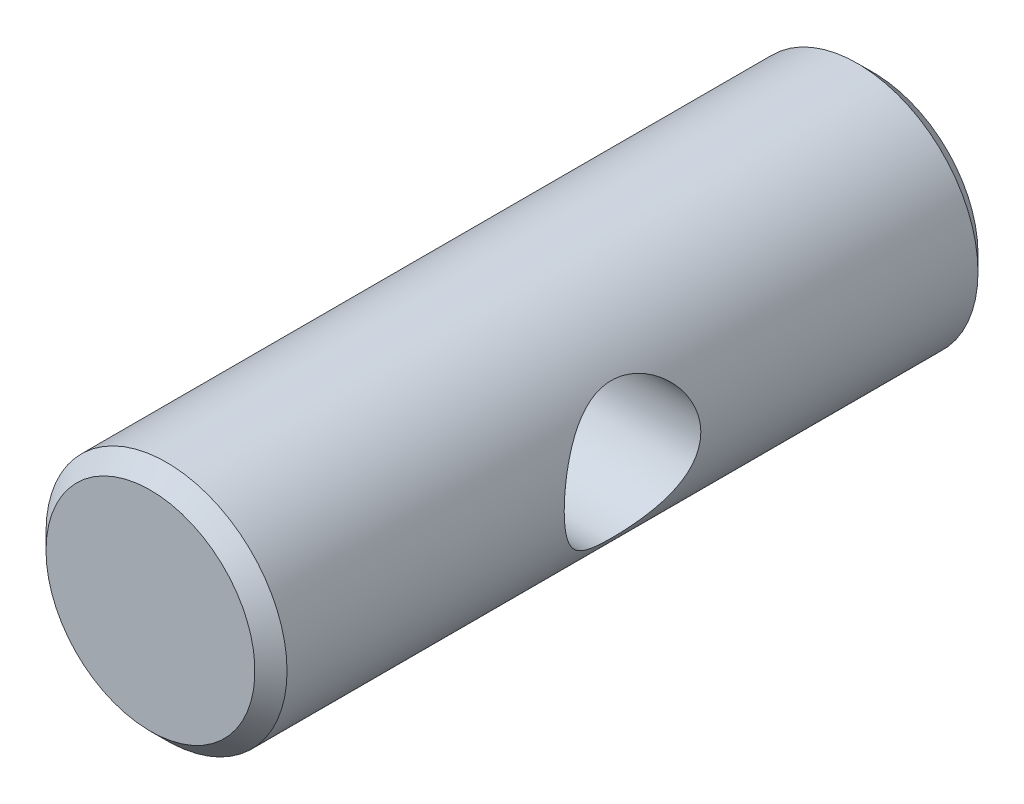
ISO-10303-21;
HEADER;
FILE_DESCRIPTION(('STEP AP214'),'2;1');
FILE_NAME('part.step','',(''),(''),'','','');
FILE_SCHEMA(('AUTOMOTIVE_DESIGN { 1 0 10303 214 1 1 1 1 }'));
ENDSEC;
DATA;
#1=APPLICATION_CONTEXT('core data for automotive mechanical design processes');
#2=APPLICATION_PROTOCOL_DEFINITION('international standard','automotive_design',2000,#1);
#3=PRODUCT_CONTEXT('',#1,'mechanical');
#4=PRODUCT('Part','Part','',(#3));
#5=PRODUCT_RELATED_PRODUCT_CATEGORY('part','',(#4));
#6=PRODUCT_DEFINITION_FORMATION('','',#4);
#7=PRODUCT_DEFINITION_CONTEXT('part definition',#1,'design');
#8=PRODUCT_DEFINITION('design','',#6,#7);
#9=PRODUCT_DEFINITION_SHAPE('','',#8);
#10=(LENGTH_UNIT() NAMED_UNIT(*) SI_UNIT(.MILLI.,.METRE.));
#11=(NAMED_UNIT(*) PLANE_ANGLE_UNIT() SI_UNIT($,.RADIAN.));
#12=(NAMED_UNIT(*) SI_UNIT($,.STERADIAN.) SOLID_ANGLE_UNIT());
#13=UNCERTAINTY_MEASURE_WITH_UNIT(LENGTH_MEASURE(1.E-05),#10,'distance_accuracy_value','');
#14=(GEOMETRIC_REPRESENTATION_CONTEXT(3) GLOBAL_UNCERTAINTY_ASSIGNED_CONTEXT((#13)) GLOBAL_UNIT_ASSIGNED_CONTEXT((#10,
#11,#12)) REPRESENTATION_CONTEXT('',''));
#15=CARTESIAN_POINT('',(0.,0.,0.));
#16=DIRECTION('',(0.,0.,1.));
#17=DIRECTION('',(1.,0.,0.));
#18=AXIS2_PLACEMENT_3D('',#15,#16,#17);
#19=CARTESIAN_POINT('',(-30.,-7.389644E-13,-45.));
#20=DIRECTION('',(0.,0.,-1.));
#21=DIRECTION('',(-1.,0.,0.));
#22=AXIS2_PLACEMENT_3D('',#19,#20,#21);
#23=PLANE('',#22);
#24=CARTESIAN_POINT('',(-30.,-7.389644E-13,-45.0000000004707));
#25=DIRECTION('',(0.,0.,1.));
#26=DIRECTION('',(1.,0.,0.));
#27=AXIS2_PLACEMENT_3D('',#24,#25,#26);
#28=CIRCLE('',#27,6.50000000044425);
#29=CARTESIAN_POINT('',(-23.4999999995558,-7.389644E-13,-45.0000000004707));
#30=VERTEX_POINT('',#29);
#31=EDGE_CURVE('E17',#30,#30,#28,.T.);
#32=ORIENTED_EDGE('',*,*,#31,.F.);
#33=EDGE_LOOP('',(#32));
#34=FACE_BOUND('',#33,.T.);
#35=ADVANCED_FACE('F14',(#34),#23,.T.);
#36=CARTESIAN_POINT('',(-30.,-7.389644E-13,0.));
#37=DIRECTION('',(0.,0.,1.));
#38=DIRECTION('',(1.,0.,0.));
#39=AXIS2_PLACEMENT_3D('',#36,#37,#38);
#40=PLANE('',#39);
#41=CARTESIAN_POINT('',(-30.,-7.389644E-13,4.54747350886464E-10));
#42=DIRECTION('',(0.,0.,-1.));
#43=DIRECTION('',(-1.,0.,0.));
#44=AXIS2_PLACEMENT_3D('',#41,#42,#43);
#45=CIRCLE('',#44,6.5000000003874);
#46=CARTESIAN_POINT('',(-36.5000000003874,-7.389644E-13,4.54747350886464E-10));
#47=VERTEX_POINT('',#46);
#48=EDGE_CURVE('E35',#47,#47,#45,.T.);
#49=ORIENTED_EDGE('',*,*,#48,.F.);
#50=EDGE_LOOP('',(#49));
#51=FACE_BOUND('',#50,.T.);
#52=ADVANCED_FACE('F75',(#51),#40,.T.);
#53=CARTESIAN_POINT('',(-30.,-7.389644E-13,-43.9999999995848));
#54=DIRECTION('',(0.,0.,1.));
#55=DIRECTION('',(1.,0.,0.));
#56=AXIS2_PLACEMENT_3D('',#53,#54,#55);
#57=CONICAL_SURFACE('',#56,7.49999999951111,0.785398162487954);
#58=ORIENTED_EDGE('',*,*,#31,.T.);
#59=EDGE_LOOP('',(#58));
#60=FACE_BOUND('',#59,.T.);
#61=CARTESIAN_POINT('',(-30.,-7.389644E-13,-44.));
#62=DIRECTION('',(0.,0.,1.));
#63=DIRECTION('',(1.,0.,0.));
#64=AXIS2_PLACEMENT_3D('',#61,#62,#63);
#65=CIRCLE('',#64,7.5);
#66=CARTESIAN_POINT('',(-22.5,-7.389644E-13,-44.));
#67=VERTEX_POINT('',#66);
#68=EDGE_CURVE('E31',#67,#67,#65,.T.);
#69=ORIENTED_EDGE('',*,*,#68,.F.);
#70=EDGE_LOOP('',(#69));
#71=FACE_BOUND('',#70,.T.);
#72=ADVANCED_FACE('F61',(#60,#71),#57,.T.);
#73=CARTESIAN_POINT('',(49.5318544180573,-1.023182E-12,-22.5));
#74=DIRECTION('',(1.,0.,0.));
#75=DIRECTION('',(0.,0.,-1.));
#76=AXIS2_PLACEMENT_3D('',#73,#74,#75);
#77=CYLINDRICAL_SURFACE('',#76,4.25);
#78=CARTESIAN_POINT('',(-37.5,-9.57479583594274E-13,-26.75));
#79=CARTESIAN_POINT('',(-37.499995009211,0.219846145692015,-26.7499937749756));
#80=CARTESIAN_POINT('',(-37.4902447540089,0.439729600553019,-26.7328555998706));
#81=CARTESIAN_POINT('',(-37.4522320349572,0.872668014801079,-26.6652163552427));
#82=CARTESIAN_POINT('',(-37.4239606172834,1.08571961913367,-26.6146991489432));
#83=CARTESIAN_POINT('',(-37.3517955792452,1.49827518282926,-26.4830148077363));
#84=CARTESIAN_POINT('',(-37.3079628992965,1.69782842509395,-26.4019671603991));
#85=CARTESIAN_POINT('',(-37.20848762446,2.08008954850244,-26.2123178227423));
#86=CARTESIAN_POINT('',(-37.1528426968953,2.26279409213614,-26.1037106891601));
#87=CARTESIAN_POINT('',(-37.0299198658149,2.62079226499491,-25.8533585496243));
#88=CARTESIAN_POINT('',(-36.9620953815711,2.79462840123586,-25.7098027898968));
#89=CARTESIAN_POINT('',(-36.823795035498,3.11715859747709,-25.3976332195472));
#90=CARTESIAN_POINT('',(-36.7533164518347,3.26582593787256,-25.2289931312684));
#91=CARTESIAN_POINT('',(-36.6088483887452,3.54980352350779,-24.8501570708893));
#92=CARTESIAN_POINT('',(-36.5352839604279,3.68200667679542,-24.6374483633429));
#93=CARTESIAN_POINT('',(-36.4025894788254,3.9082127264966,-24.1885900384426));
#94=CARTESIAN_POINT('',(-36.3434386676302,4.00227068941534,-23.952474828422));
#95=CARTESIAN_POINT('',(-36.2593418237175,4.13223693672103,-23.51383410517));
#96=CARTESIAN_POINT('',(-36.2298305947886,4.17619028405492,-23.3146032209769));
#97=CARTESIAN_POINT('',(-36.1999032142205,4.22036394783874,-23.0113761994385));
#98=CARTESIAN_POINT('',(-36.192317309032,4.23146245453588,-22.9095648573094));
#99=CARTESIAN_POINT('',(-36.1821684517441,4.24627911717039,-22.7051691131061));
#100=CARTESIAN_POINT('',(-36.1796038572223,4.2499996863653,-22.6025849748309));
#101=CARTESIAN_POINT('',(-36.1796032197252,4.25000033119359,-22.3916711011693));
#102=CARTESIAN_POINT('',(-36.1824623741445,4.24585213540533,-22.2833412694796));
#103=CARTESIAN_POINT('',(-36.1937757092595,4.22933110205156,-22.0676062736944));
#104=CARTESIAN_POINT('',(-36.2022301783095,4.21695784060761,-21.960201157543));
#105=CARTESIAN_POINT('',(-36.2243965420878,4.18416996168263,-21.7471072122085));
#106=CARTESIAN_POINT('',(-36.2381118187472,4.16375017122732,-21.6414195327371));
#107=CARTESIAN_POINT('',(-36.2702678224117,4.11516514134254,-21.4325583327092));
#108=CARTESIAN_POINT('',(-36.2887106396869,4.08699647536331,-21.3293859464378));
#109=CARTESIAN_POINT('',(-36.3498977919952,3.99180305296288,-21.0260070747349));
#110=CARTESIAN_POINT('',(-36.3986837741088,3.91383729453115,-20.8303371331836));
#111=CARTESIAN_POINT('',(-36.506679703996,3.7315268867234,-20.4550422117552));
#112=CARTESIAN_POINT('',(-36.5658929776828,3.62717381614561,-20.275422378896));
#113=CARTESIAN_POINT('',(-36.6958104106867,3.38192199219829,-19.9159323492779));
#114=CARTESIAN_POINT('',(-36.7670652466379,3.23829702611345,-19.7381204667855));
#115=CARTESIAN_POINT('',(-36.9086567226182,2.92405873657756,-19.4073623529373));
#116=CARTESIAN_POINT('',(-36.9789926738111,2.75342629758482,-19.254433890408));
#117=CARTESIAN_POINT('',(-37.0820805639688,2.47092921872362,-19.0398319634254));
#118=CARTESIAN_POINT('',(-37.1174294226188,2.36743999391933,-18.9681933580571));
#119=CARTESIAN_POINT('',(-37.1849667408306,2.15378373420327,-18.8339919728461));
#120=CARTESIAN_POINT('',(-37.2171565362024,2.04361955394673,-18.7714253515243));
#121=CARTESIAN_POINT('',(-37.2774314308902,1.81732848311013,-18.6560532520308));
#122=CARTESIAN_POINT('',(-37.3055199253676,1.70120663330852,-18.6032396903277));
#123=CARTESIAN_POINT('',(-37.3567709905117,1.46379338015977,-18.5079850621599));
#124=CARTESIAN_POINT('',(-37.3799348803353,1.34250337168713,-18.4655412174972));
#125=CARTESIAN_POINT('',(-37.4325103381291,1.02323695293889,-18.3699686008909));
#126=CARTESIAN_POINT('',(-37.4576336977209,0.821957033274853,-18.3251440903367));
#127=CARTESIAN_POINT('',(-37.4913769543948,0.413793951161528,-18.2651639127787));
#128=CARTESIAN_POINT('',(-37.5000046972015,0.206913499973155,-18.2499941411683));
#129=CARTESIAN_POINT('',(-37.499995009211,-0.219846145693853,-18.2500062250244));
#130=CARTESIAN_POINT('',(-37.4902447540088,-0.439729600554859,-18.2671444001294));
#131=CARTESIAN_POINT('',(-37.4522320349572,-0.872668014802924,-18.3347836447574));
#132=CARTESIAN_POINT('',(-37.4239606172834,-1.08571961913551,-18.3853008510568));
#133=CARTESIAN_POINT('',(-37.3517955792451,-1.49827518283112,-18.5169851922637));
#134=CARTESIAN_POINT('',(-37.3079628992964,-1.69782842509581,-18.5980328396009));
#135=CARTESIAN_POINT('',(-37.2084876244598,-2.08008954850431,-18.7876821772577));
#136=CARTESIAN_POINT('',(-37.1528426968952,-2.26279409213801,-18.8962893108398));
#137=CARTESIAN_POINT('',(-37.0299198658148,-2.62079226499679,-19.1466414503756));
#138=CARTESIAN_POINT('',(-36.9620953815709,-2.79462840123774,-19.2901972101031));
#139=CARTESIAN_POINT('',(-36.8237950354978,-3.11715859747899,-19.6023667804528));
#140=CARTESIAN_POINT('',(-36.7533164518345,-3.26582593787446,-19.7710068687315));
#141=CARTESIAN_POINT('',(-36.608848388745,-3.54980352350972,-20.1498429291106));
#142=CARTESIAN_POINT('',(-36.5352839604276,-3.68200667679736,-20.362551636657));
#143=CARTESIAN_POINT('',(-36.4025894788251,-3.90821272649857,-20.8114099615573));
#144=CARTESIAN_POINT('',(-36.3434386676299,-4.00227068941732,-21.0475251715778));
#145=CARTESIAN_POINT('',(-36.2593418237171,-4.13223693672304,-21.4861658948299));
#146=CARTESIAN_POINT('',(-36.2298305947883,-4.17619028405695,-21.685396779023));
#147=CARTESIAN_POINT('',(-36.1999032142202,-4.22036394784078,-21.9886238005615));
#148=CARTESIAN_POINT('',(-36.1923173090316,-4.23146245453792,-22.0904351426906));
#149=CARTESIAN_POINT('',(-36.1821684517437,-4.24627911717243,-22.2948308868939));
#150=CARTESIAN_POINT('',(-36.1796038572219,-4.24999968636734,-22.3974150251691));
#151=CARTESIAN_POINT('',(-36.1796032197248,-4.25000033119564,-22.6083288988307));
#152=CARTESIAN_POINT('',(-36.1824623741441,-4.24585213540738,-22.7166587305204));
#153=CARTESIAN_POINT('',(-36.1937757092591,-4.22933110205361,-22.9323937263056));
#154=CARTESIAN_POINT('',(-36.2022301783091,-4.21695784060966,-23.039798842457));
#155=CARTESIAN_POINT('',(-36.2243965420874,-4.18416996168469,-23.2528927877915));
#156=CARTESIAN_POINT('',(-36.2381118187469,-4.16375017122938,-23.3585804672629));
#157=CARTESIAN_POINT('',(-36.2702678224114,-4.1151651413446,-23.5674416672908));
#158=CARTESIAN_POINT('',(-36.2887106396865,-4.08699647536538,-23.6706140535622));
#159=CARTESIAN_POINT('',(-36.3498977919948,-3.99180305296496,-23.9739929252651));
#160=CARTESIAN_POINT('',(-36.3986837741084,-3.91383729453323,-24.1696628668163));
#161=CARTESIAN_POINT('',(-36.5066797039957,-3.7315268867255,-24.5449577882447));
#162=CARTESIAN_POINT('',(-36.5658929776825,-3.62717381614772,-24.724577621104));
#163=CARTESIAN_POINT('',(-36.6958104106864,-3.38192199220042,-25.0840676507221));
#164=CARTESIAN_POINT('',(-36.7670652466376,-3.23829702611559,-25.2618795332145));
#165=CARTESIAN_POINT('',(-36.9086567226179,-2.92405873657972,-25.5926376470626));
#166=CARTESIAN_POINT('',(-36.9789926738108,-2.75342629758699,-25.745566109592));
#167=CARTESIAN_POINT('',(-37.0820805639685,-2.4709292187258,-25.9601680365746));
#168=CARTESIAN_POINT('',(-37.1174294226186,-2.36743999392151,-26.0318066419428));
#169=CARTESIAN_POINT('',(-37.1849667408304,-2.15378373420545,-26.1660080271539));
#170=CARTESIAN_POINT('',(-37.2171565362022,-2.04361955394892,-26.2285746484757));
#171=CARTESIAN_POINT('',(-37.2774314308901,-1.81732848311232,-26.3439467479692));
#172=CARTESIAN_POINT('',(-37.3055199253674,-1.7012066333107,-26.3967603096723));
#173=CARTESIAN_POINT('',(-37.3567709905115,-1.46379338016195,-26.4920149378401));
#174=CARTESIAN_POINT('',(-37.3799348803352,-1.34250337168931,-26.5344587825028));
#175=CARTESIAN_POINT('',(-37.432510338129,-1.02323695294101,-26.6300313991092));
#176=CARTESIAN_POINT('',(-37.4576336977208,-0.821957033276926,-26.6748559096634));
#177=CARTESIAN_POINT('',(-37.4913769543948,-0.413793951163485,-26.7348360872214));
#178=CARTESIAN_POINT('',(-37.5000046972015,-0.206913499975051,-26.7500058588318));
#179=CARTESIAN_POINT('',(-37.5,-9.57479583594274E-13,-26.75));
#180=B_SPLINE_CURVE_WITH_KNOTS('',3,(#78,#79,#80,#81,#82,#83,#84,#85,#86,#87,#88,#89,#90,#91,
#92,#93,#94,#95,#96,#97,#98,#99,#100,#101,#102,#103,#104,#105,#106,#107,#108,#109,#110,#111,
#112,#113,#114,#115,#116,#117,#118,#119,#120,#121,#122,#123,#124,#125,#126,#127,#128,#129,#130,
#131,#132,#133,#134,#135,#136,#137,#138,#139,#140,#141,#142,#143,#144,#145,#146,#147,#148,#149,
#150,#151,#152,#153,#154,#155,#156,#157,#158,#159,#160,#161,#162,#163,#164,#165,#166,#167,#168,
#169,#170,#171,#172,#173,#174,#175,#176,#177,#178,#179),.UNSPECIFIED.,.T.,.F.,(4,2,2,2,2,2,2,2,
2,2,2,2,2,2,2,2,2,2,2,2,2,2,2,2,2,2,2,2,2,2,2,2,2,2,2,2,2,2,2,2,2,2,2,2,2,2,2,2,2,2,4),(0.,
0.658750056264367,1.31781881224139,1.97433451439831,2.63097998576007,3.33444980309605,
4.03866181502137,4.81784642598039,5.59590216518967,6.21133078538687,6.51907795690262,
6.82672445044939,7.15159664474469,7.47648558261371,7.80158372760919,8.12682586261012,
8.77247651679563,9.4183334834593,10.1337797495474,10.8497346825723,11.2414971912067,
11.6330933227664,12.0243634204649,12.4155285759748,13.0358221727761,13.6558206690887,
14.314570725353,14.9736394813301,15.630155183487,16.2868006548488,16.9902704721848,
17.6944824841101,18.4736670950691,19.2517228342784,19.8671514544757,20.1748986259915,
20.4825451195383,20.8074173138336,21.1323062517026,21.4574043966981,21.782646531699,
22.4282971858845,23.0741541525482,23.7896004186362,24.5055553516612,24.8973178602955,
25.2889139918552,25.6801840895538,26.0713492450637,26.6916428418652,27.3116413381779),.UNSPECIFIED.);
#181=CARTESIAN_POINT('',(-37.5,-9.57479583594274E-13,-26.75));
#182=VERTEX_POINT('',#181);
#183=EDGE_CURVE('E21',#182,#182,#180,.T.);
#184=ORIENTED_EDGE('',*,*,#183,.F.);
#185=EDGE_LOOP('',(#184));
#186=FACE_BOUND('',#185,.T.);
#187=CARTESIAN_POINT('',(-22.5,-8.81792679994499E-13,-26.75));
#188=CARTESIAN_POINT('',(-22.5000049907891,-0.219846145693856,-26.7499937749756));
#189=CARTESIAN_POINT('',(-22.5097552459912,-0.439729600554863,-26.7328555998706));
#190=CARTESIAN_POINT('',(-22.5477679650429,-0.872668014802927,-26.6652163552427));
#191=CARTESIAN_POINT('',(-22.5760393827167,-1.08571961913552,-26.6146991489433));
#192=CARTESIAN_POINT('',(-22.648204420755,-1.49827518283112,-26.4830148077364));
#193=CARTESIAN_POINT('',(-22.6920371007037,-1.69782842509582,-26.4019671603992));
#194=CARTESIAN_POINT('',(-22.7915123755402,-2.08008954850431,-26.2123178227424));
#195=CARTESIAN_POINT('',(-22.8471573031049,-2.26279409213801,-26.1037106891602));
#196=CARTESIAN_POINT('',(-22.9700801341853,-2.6207922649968,-25.8533585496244));
#197=CARTESIAN_POINT('',(-23.0379046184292,-2.79462840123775,-25.7098027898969));
#198=CARTESIAN_POINT('',(-23.1762049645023,-3.11715859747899,-25.3976332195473));
#199=CARTESIAN_POINT('',(-23.2466835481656,-3.26582593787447,-25.2289931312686));
#200=CARTESIAN_POINT('',(-23.3911516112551,-3.54980352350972,-24.8501570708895));
#201=CARTESIAN_POINT('',(-23.4647160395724,-3.68200667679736,-24.637448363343));
#202=CARTESIAN_POINT('',(-23.597410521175,-3.90821272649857,-24.1885900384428));
#203=CARTESIAN_POINT('',(-23.6565613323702,-4.00227068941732,-23.9524748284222));
#204=CARTESIAN_POINT('',(-23.740658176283,-4.13223693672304,-23.5138341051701));
#205=CARTESIAN_POINT('',(-23.7701694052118,-4.17619028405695,-23.3146032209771));
#206=CARTESIAN_POINT('',(-23.8000967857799,-4.22036394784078,-23.0113761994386));
#207=CARTESIAN_POINT('',(-23.8076826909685,-4.23146245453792,-22.9095648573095));
#208=CARTESIAN_POINT('',(-23.8178315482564,-4.24627911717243,-22.7051691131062));
#209=CARTESIAN_POINT('',(-23.8203961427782,-4.24999968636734,-22.602584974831));
#210=CARTESIAN_POINT('',(-23.8203967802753,-4.25000033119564,-22.3916711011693));
#211=CARTESIAN_POINT('',(-23.817537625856,-4.24585213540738,-22.2833412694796));
#212=CARTESIAN_POINT('',(-23.806224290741,-4.22933110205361,-22.0676062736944));
#213=CARTESIAN_POINT('',(-23.797769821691,-4.21695784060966,-21.960201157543));
#214=CARTESIAN_POINT('',(-23.7756034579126,-4.18416996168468,-21.7471072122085));
#215=CARTESIAN_POINT('',(-23.7618881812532,-4.16375017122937,-21.6414195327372));
#216=CARTESIAN_POINT('',(-23.7297321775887,-4.11516514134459,-21.4325583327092));
#217=CARTESIAN_POINT('',(-23.7112893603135,-4.08699647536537,-21.3293859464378));
#218=CARTESIAN_POINT('',(-23.6501022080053,-3.99180305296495,-21.0260070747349));
#219=CARTESIAN_POINT('',(-23.6013162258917,-3.91383729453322,-20.8303371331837));
#220=CARTESIAN_POINT('',(-23.4933202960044,-3.73152688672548,-20.4550422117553));
#221=CARTESIAN_POINT('',(-23.4341070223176,-3.6271738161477,-20.275422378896));
#222=CARTESIAN_POINT('',(-23.3041895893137,-3.3819219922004,-19.915932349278));
#223=CARTESIAN_POINT('',(-23.2329347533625,-3.23829702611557,-19.7381204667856));
#224=CARTESIAN_POINT('',(-23.0913432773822,-2.9240587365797,-19.4073623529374));
#225=CARTESIAN_POINT('',(-23.0210073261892,-2.75342629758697,-19.2544338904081));
#226=CARTESIAN_POINT('',(-22.9179194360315,-2.47092921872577,-19.0398319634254));
#227=CARTESIAN_POINT('',(-22.8825705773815,-2.36743999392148,-18.9681933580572));
#228=CARTESIAN_POINT('',(-22.8150332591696,-2.15378373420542,-18.8339919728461));
#229=CARTESIAN_POINT('',(-22.7828434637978,-2.04361955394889,-18.7714253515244));
#230=CARTESIAN_POINT('',(-22.72256856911,-1.81732848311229,-18.6560532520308));
#231=CARTESIAN_POINT('',(-22.6944800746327,-1.70120663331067,-18.6032396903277));
#232=CARTESIAN_POINT('',(-22.6432290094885,-1.46379338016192,-18.50798506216));
#233=CARTESIAN_POINT('',(-22.6200651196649,-1.34250337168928,-18.4655412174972));
#234=CARTESIAN_POINT('',(-22.5674896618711,-1.02323695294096,-18.3699686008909));
#235=CARTESIAN_POINT('',(-22.5423663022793,-0.821957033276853,-18.3251440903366));
#236=CARTESIAN_POINT('',(-22.5086230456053,-0.413793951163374,-18.2651639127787));
#237=CARTESIAN_POINT('',(-22.4999953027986,-0.206913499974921,-18.2499941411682));
#238=CARTESIAN_POINT('',(-22.5000049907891,0.219846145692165,-18.2500062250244));
#239=CARTESIAN_POINT('',(-22.5097552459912,0.439729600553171,-18.2671444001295));
#240=CARTESIAN_POINT('',(-22.5477679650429,0.872668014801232,-18.3347836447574));
#241=CARTESIAN_POINT('',(-22.5760393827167,1.08571961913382,-18.3853008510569));
#242=CARTESIAN_POINT('',(-22.6482044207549,1.49827518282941,-18.5169851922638));
#243=CARTESIAN_POINT('',(-22.6920371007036,1.6978284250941,-18.598032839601));
#244=CARTESIAN_POINT('',(-22.7915123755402,2.08008954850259,-18.7876821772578));
#245=CARTESIAN_POINT('',(-22.8471573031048,2.26279409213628,-18.89628931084));
#246=CARTESIAN_POINT('',(-22.9700801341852,2.62079226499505,-19.1466414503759));
#247=CARTESIAN_POINT('',(-23.037904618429,2.79462840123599,-19.2901972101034));
#248=CARTESIAN_POINT('',(-23.1762049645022,3.11715859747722,-19.602366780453));
#249=CARTESIAN_POINT('',(-23.2466835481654,3.26582593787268,-19.7710068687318));
#250=CARTESIAN_POINT('',(-23.3911516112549,3.54980352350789,-20.1498429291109));
#251=CARTESIAN_POINT('',(-23.4647160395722,3.68200667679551,-20.3625516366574));
#252=CARTESIAN_POINT('',(-23.5974105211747,3.90821272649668,-20.8114099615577));
#253=CARTESIAN_POINT('',(-23.6565613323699,4.00227068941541,-21.0475251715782));
#254=CARTESIAN_POINT('',(-23.7406581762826,4.13223693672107,-21.4861658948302));
#255=CARTESIAN_POINT('',(-23.7701694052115,4.17619028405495,-21.6853967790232));
#256=CARTESIAN_POINT('',(-23.8000967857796,4.22036394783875,-21.9886238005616));
#257=CARTESIAN_POINT('',(-23.8076826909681,4.23146245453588,-22.0904351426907));
#258=CARTESIAN_POINT('',(-23.817831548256,4.24627911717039,-22.294830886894));
#259=CARTESIAN_POINT('',(-23.8203961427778,4.2499996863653,-22.3974150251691));
#260=CARTESIAN_POINT('',(-23.8203967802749,4.25000033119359,-22.6083288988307));
#261=CARTESIAN_POINT('',(-23.8175376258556,4.24585213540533,-22.7166587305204));
#262=CARTESIAN_POINT('',(-23.8062242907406,4.22933110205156,-22.9323937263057));
#263=CARTESIAN_POINT('',(-23.7977698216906,4.21695784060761,-23.0397988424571));
#264=CARTESIAN_POINT('',(-23.7756034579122,4.18416996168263,-23.2528927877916));
#265=CARTESIAN_POINT('',(-23.7618881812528,4.16375017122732,-23.3585804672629));
#266=CARTESIAN_POINT('',(-23.7297321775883,4.11516514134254,-23.5674416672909));
#267=CARTESIAN_POINT('',(-23.7112893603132,4.08699647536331,-23.6706140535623));
#268=CARTESIAN_POINT('',(-23.6501022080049,3.99180305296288,-23.9739929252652));
#269=CARTESIAN_POINT('',(-23.6013162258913,3.91383729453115,-24.1696628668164));
#270=CARTESIAN_POINT('',(-23.493320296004,3.7315268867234,-24.5449577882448));
#271=CARTESIAN_POINT('',(-23.4341070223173,3.62717381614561,-24.7245776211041));
#272=CARTESIAN_POINT('',(-23.3041895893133,3.38192199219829,-25.0840676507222));
#273=CARTESIAN_POINT('',(-23.2329347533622,3.23829702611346,-25.2618795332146));
#274=CARTESIAN_POINT('',(-23.0913432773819,2.92405873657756,-25.5926376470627));
#275=CARTESIAN_POINT('',(-23.021007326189,2.75342629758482,-25.7455661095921));
#276=CARTESIAN_POINT('',(-22.9179194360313,2.47092921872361,-25.9601680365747));
#277=CARTESIAN_POINT('',(-22.8825705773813,2.36743999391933,-26.0318066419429));
#278=CARTESIAN_POINT('',(-22.8150332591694,2.15378373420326,-26.166008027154));
#279=CARTESIAN_POINT('',(-22.7828434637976,2.04361955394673,-26.2285746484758));
#280=CARTESIAN_POINT('',(-22.7225685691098,1.81732848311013,-26.3439467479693));
#281=CARTESIAN_POINT('',(-22.6944800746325,1.70120663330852,-26.3967603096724));
#282=CARTESIAN_POINT('',(-22.6432290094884,1.46379338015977,-26.4920149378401));
#283=CARTESIAN_POINT('',(-22.6200651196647,1.34250337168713,-26.5344587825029));
#284=CARTESIAN_POINT('',(-22.567489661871,1.02323695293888,-26.6300313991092));
#285=CARTESIAN_POINT('',(-22.5423663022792,0.82195703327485,-26.6748559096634));
#286=CARTESIAN_POINT('',(-22.5086230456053,0.413793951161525,-26.7348360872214));
#287=CARTESIAN_POINT('',(-22.4999953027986,0.206913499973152,-26.7500058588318));
#288=CARTESIAN_POINT('',(-22.5,-8.81792679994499E-13,-26.75));
#289=B_SPLINE_CURVE_WITH_KNOTS('',3,(#187,#188,#189,#190,#191,#192,#193,#194,#195,#196,#197,
#198,#199,#200,#201,#202,#203,#204,#205,#206,#207,#208,#209,#210,#211,#212,#213,#214,#215,#216,
#217,#218,#219,#220,#221,#222,#223,#224,#225,#226,#227,#228,#229,#230,#231,#232,#233,#234,#235,
#236,#237,#238,#239,#240,#241,#242,#243,#244,#245,#246,#247,#248,#249,#250,#251,#252,#253,#254,
#255,#256,#257,#258,#259,#260,#261,#262,#263,#264,#265,#266,#267,#268,#269,#270,#271,#272,#273,
#274,#275,#276,#277,#278,#279,#280,#281,#282,#283,#284,#285,#286,#287,#288),.UNSPECIFIED.,.T.,
.F.,(4,2,2,2,2,2,2,2,2,2,2,2,2,2,2,2,2,2,2,2,2,2,2,2,2,2,2,2,2,2,2,2,2,2,2,2,2,2,2,2,2,2,2,2,2,
2,2,2,2,2,4),(0.,0.658750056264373,1.3178188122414,1.97433451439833,2.63097998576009,
3.33444980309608,4.03866181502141,4.81784642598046,5.59590216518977,6.21133078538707,
6.51907795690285,6.82672445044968,7.15159664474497,7.47648558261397,7.80158372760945,
8.12682586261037,8.77247651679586,9.41833348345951,10.1337797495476,10.8497346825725,
11.2414971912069,11.6330933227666,12.0243634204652,12.4155285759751,13.0358221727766,
13.6558206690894,14.3145707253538,14.9736394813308,15.6301551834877,16.2868006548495,
16.9902704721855,17.6944824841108,18.4736670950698,19.2517228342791,19.8671514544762,
20.1748986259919,20.4825451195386,20.8074173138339,21.132306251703,21.4574043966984,
21.7826465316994,22.4282971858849,23.0741541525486,23.7896004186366,24.5055553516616,
24.8973178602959,25.2889139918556,25.6801840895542,26.0713492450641,26.6916428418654,
27.3116413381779),.UNSPECIFIED.);
#290=CARTESIAN_POINT('',(-22.5,-8.81792679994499E-13,-26.75));
#291=VERTEX_POINT('',#290);
#292=EDGE_CURVE('E26',#291,#291,#289,.T.);
#293=ORIENTED_EDGE('',*,*,#292,.F.);
#294=EDGE_LOOP('',(#293));
#295=FACE_BOUND('',#294,.T.);
#296=ADVANCED_FACE('F44',(#186,#295),#77,.F.);
#297=CARTESIAN_POINT('',(-30.,-7.389644E-13,-1.00000000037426));
#298=DIRECTION('',(0.,0.,-1.));
#299=DIRECTION('',(-1.,0.,0.));
#300=AXIS2_PLACEMENT_3D('',#297,#298,#299);
#301=CONICAL_SURFACE('',#300,7.49999999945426,0.785398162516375);
#302=ORIENTED_EDGE('',*,*,#48,.T.);
#303=EDGE_LOOP('',(#302));
#304=FACE_BOUND('',#303,.T.);
#305=CARTESIAN_POINT('',(-30.,-7.389644E-13,-1.00000000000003));
#306=DIRECTION('',(0.,0.,1.));
#307=DIRECTION('',(1.,0.,0.));
#308=AXIS2_PLACEMENT_3D('',#305,#306,#307);
#309=CIRCLE('',#308,7.5);
#310=CARTESIAN_POINT('',(-22.5,-7.389644E-13,-1.00000000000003));
#311=VERTEX_POINT('',#310);
#312=EDGE_CURVE('E10',#311,#311,#309,.F.);
#313=ORIENTED_EDGE('',*,*,#312,.F.);
#314=EDGE_LOOP('',(#313));
#315=FACE_BOUND('',#314,.T.);
#316=ADVANCED_FACE('F51',(#304,#315),#301,.T.);
#317=CARTESIAN_POINT('',(-30.,-7.389644E-13,-22.5));
#318=DIRECTION('',(0.,0.,1.));
#319=DIRECTION('',(1.,0.,0.));
#320=AXIS2_PLACEMENT_3D('',#317,#318,#319);
#321=CYLINDRICAL_SURFACE('',#320,7.5);
#322=ORIENTED_EDGE('',*,*,#312,.T.);
#323=EDGE_LOOP('',(#322));
#324=FACE_BOUND('',#323,.T.);
#325=ORIENTED_EDGE('',*,*,#183,.T.);
#326=EDGE_LOOP('',(#325));
#327=FACE_BOUND('',#326,.T.);
#328=ORIENTED_EDGE('',*,*,#292,.T.);
#329=EDGE_LOOP('',(#328));
#330=FACE_BOUND('',#329,.T.);
#331=ORIENTED_EDGE('',*,*,#68,.T.);
#332=EDGE_LOOP('',(#331));
#333=FACE_BOUND('',#332,.T.);
#334=ADVANCED_FACE('F48',(#324,#327,#330,#333),#321,.T.);
#335=CLOSED_SHELL('',(#35,#52,#72,#296,#316,#334));
#336=MANIFOLD_SOLID_BREP('B1',#335);
#337=ADVANCED_BREP_SHAPE_REPRESENTATION('',(#18,#336),#14);
#338=SHAPE_DEFINITION_REPRESENTATION(#9,#337);
ENDSEC;
END-ISO-10303-21;
